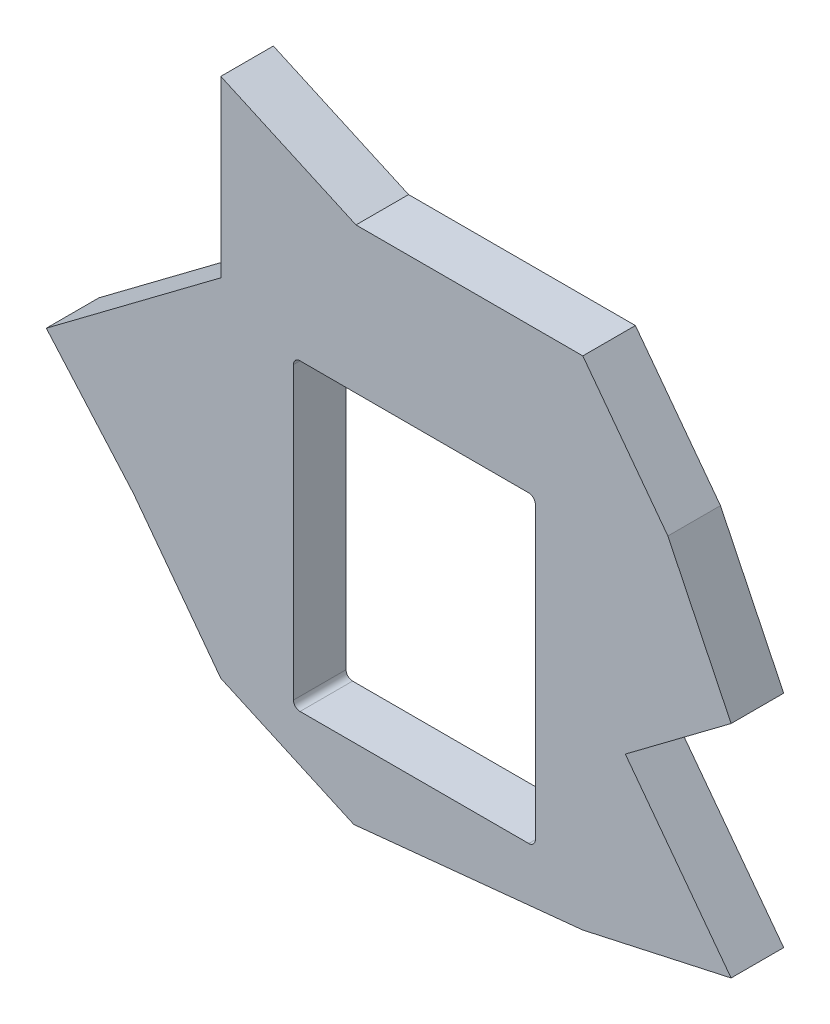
from build123d import *

# Parameters (mm, degrees)
ESQUISSE1_W             = 700
ESQUISSE1_H             = 1890
EXTRUSION1_DEPTH        = 40
ESQUISSE2_OUTSIDE_W     = 1105.172
ESQUISSE2_OUTSIDE_H     = 2295.172
ENL_V_MAT_EXTRU_1_DEPTH = 1762.709778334


with BuildPart() as part:
    # Esquisse1 → Extrusion1 (new body)
    with BuildSketch(Plane.XY):
        with Locations((-46.084956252, 771.140451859)):
            Rectangle(ESQUISSE1_W, ESQUISSE1_H)
        with BuildLine():
            Line((-92, 106.15), (-92, -114.85))
            ThreePointArc((-92, -114.85), (-90.535533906, -118.385533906), (-87, -119.85))
            Line((-87, -119.85), (87, -119.85))
            ThreePointArc((87, -119.85), (90.535533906, -118.385533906), (92, -114.85))
            Line((92, -114.85), (92, 106.15))
            ThreePointArc((92, 106.15), (90.535533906, 109.685533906), (87, 111.15))
            Line((87, 111.15), (-87, 111.15))
            ThreePointArc((-87, 111.15), (-90.535533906, 109.685533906), (-92, 106.15))
        make_face(mode=Mode.SUBTRACT)
    extrude(amount=EXTRUSION1_DEPTH)

    # Esquisse2 outside → Enl_v. mat.-Extru.1 (cut, through all)
    with BuildSketch(Plane(origin=(0, 0, 0), x_dir=(-1, 0, 0), z_dir=(0, 0, -1))):
        with Locations((46.085, 771.14)):
            Rectangle(ESQUISSE2_OUTSIDE_W, ESQUISSE2_OUTSIDE_H)
        Polygon((280.021607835, 36.147993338), (147.291592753, 135.69550465), (147.291592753, 268.425519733), (44.425831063, 221.970014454), (-128.123188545, 221.970014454), (-192.829070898, 135.69550465), (-240.943701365, 36.147993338), (-160.476129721, -24.202685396), (-240.943701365, -131.492780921), (-128.123188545, -156.310528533), (46.084956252, -173.859548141), (147.291592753, -128.153325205), (213.656600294, -39.666648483), align=None, mode=Mode.SUBTRACT)
    extrude(amount=-ENL_V_MAT_EXTRU_1_DEPTH, mode=Mode.SUBTRACT)


solid = part.part
